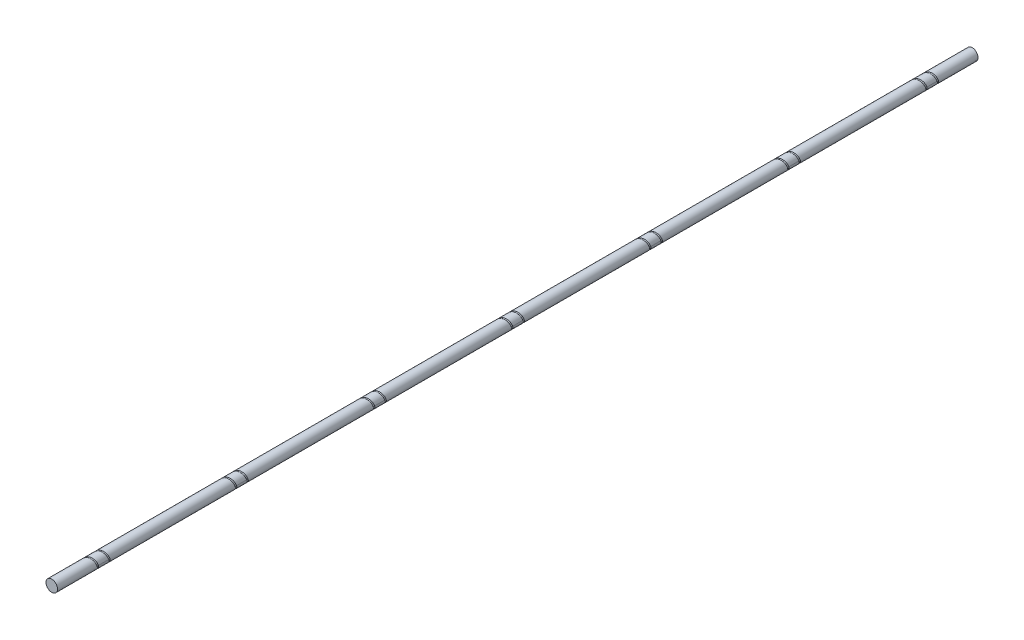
from build123d import *

# Parameters (mm, degrees)
SKETCH1_R              = 25
BOSS_EXTRUDE1_DEPTH    = 4000
CUT_SWEEP1_PITCH       = 50
CUT_SWEEP1_HEIGHT      = 100
CUT_SWEEP1_RADIUS      = 27.646
CUT_SWEEP1_START_ANGLE = -180
SKETCH3_R              = 3.969
LPATTERN1_COUNT        = 7
LPATTERN1_PITCH        = 600


with BuildPart() as part:
    # Sketch1 → Boss-Extrude1 (new body)
    with BuildSketch(Plane.XY):
        Circle(SKETCH1_R)
    extrude(amount=BOSS_EXTRUDE1_DEPTH)

    # Cut-Sweep1: sweep along a helix
    with BuildLine() as cut_sweep1_path:
        add(Helix(CUT_SWEEP1_PITCH, CUT_SWEEP1_HEIGHT, CUT_SWEEP1_RADIUS, center=(0, 0, 150), direction=(0, 0, 1), mode=Mode.PRIVATE).rotate(Axis((0, 0, 150), (0, 0, 1)), CUT_SWEEP1_START_ANGLE))
    # Sketch3 → Cut-Sweep1 (sweep, cut)
    with BuildSketch(Plane(origin=(0, 0, 0), x_dir=(1, 0, 0), z_dir=(0, 1, 0))):
        with Locations((-27.646, -150)):
            Circle(SKETCH3_R)
    cut_sweep1 = sweep(path=cut_sweep1_path.line, is_frenet=True, mode=Mode.SUBTRACT)

    # LPattern1: Cut-Sweep1 ×7
    with Locations(*[(0, 0, i * LPATTERN1_PITCH) for i in range(1, LPATTERN1_COUNT)]):
        add(cut_sweep1, mode=Mode.SUBTRACT)


solid = part.part
